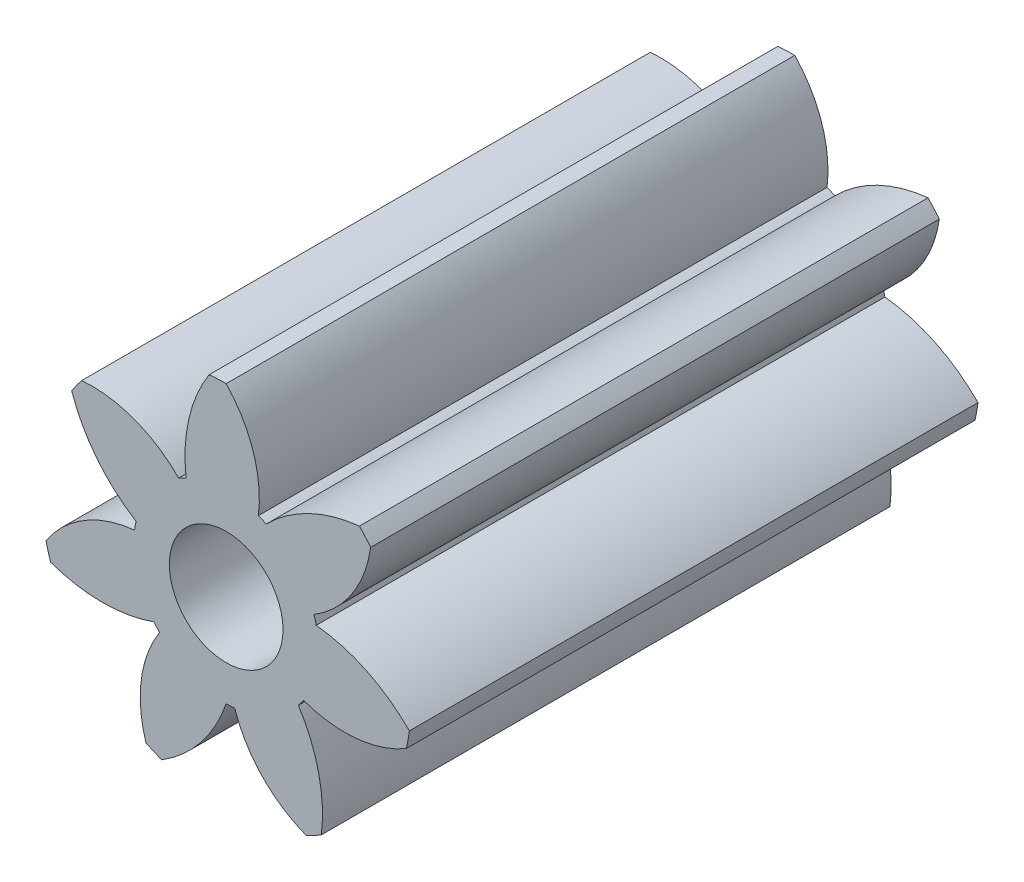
ISO-10303-21;
HEADER;
FILE_DESCRIPTION(('STEP AP214'),'2;1');
FILE_NAME('part.step','',(''),(''),'','','');
FILE_SCHEMA(('AUTOMOTIVE_DESIGN { 1 0 10303 214 1 1 1 1 }'));
ENDSEC;
DATA;
#1=APPLICATION_CONTEXT('core data for automotive mechanical design processes');
#2=APPLICATION_PROTOCOL_DEFINITION('international standard','automotive_design',2000,#1);
#3=PRODUCT_CONTEXT('',#1,'mechanical');
#4=PRODUCT('Part','Part','',(#3));
#5=PRODUCT_RELATED_PRODUCT_CATEGORY('part','',(#4));
#6=PRODUCT_DEFINITION_FORMATION('','',#4);
#7=PRODUCT_DEFINITION_CONTEXT('part definition',#1,'design');
#8=PRODUCT_DEFINITION('design','',#6,#7);
#9=PRODUCT_DEFINITION_SHAPE('','',#8);
#10=(LENGTH_UNIT() NAMED_UNIT(*) SI_UNIT(.MILLI.,.METRE.));
#11=(NAMED_UNIT(*) PLANE_ANGLE_UNIT() SI_UNIT($,.RADIAN.));
#12=(NAMED_UNIT(*) SI_UNIT($,.STERADIAN.) SOLID_ANGLE_UNIT());
#13=UNCERTAINTY_MEASURE_WITH_UNIT(LENGTH_MEASURE(1.E-05),#10,'distance_accuracy_value','');
#14=(GEOMETRIC_REPRESENTATION_CONTEXT(3) GLOBAL_UNCERTAINTY_ASSIGNED_CONTEXT((#13)) GLOBAL_UNIT_ASSIGNED_CONTEXT((#10,
#11,#12)) REPRESENTATION_CONTEXT('',''));
#15=CARTESIAN_POINT('',(0.,0.,0.));
#16=DIRECTION('',(0.,0.,1.));
#17=DIRECTION('',(1.,0.,0.));
#18=AXIS2_PLACEMENT_3D('',#15,#16,#17);
#19=CARTESIAN_POINT('',(0.,0.,4.));
#20=DIRECTION('',(0.,0.,1.));
#21=DIRECTION('',(1.,0.,0.));
#22=AXIS2_PLACEMENT_3D('',#19,#20,#21);
#23=PLANE('',#22);
#24=CARTESIAN_POINT('',(0.,0.,4.));
#25=DIRECTION('',(0.,0.,1.));
#26=DIRECTION('',(1.,0.,0.));
#27=AXIS2_PLACEMENT_3D('',#24,#25,#26);
#28=CIRCLE('',#27,0.4);
#29=CARTESIAN_POINT('',(0.4,0.,4.));
#30=VERTEX_POINT('',#29);
#31=EDGE_CURVE('E251',#30,#30,#28,.T.);
#32=ORIENTED_EDGE('',*,*,#31,.F.);
#33=EDGE_LOOP('',(#32));
#34=FACE_BOUND('',#33,.T.);
#35=CARTESIAN_POINT('',(0.,0.,4.));
#36=DIRECTION('',(0.,0.,1.));
#37=DIRECTION('',(1.,0.,0.));
#38=AXIS2_PLACEMENT_3D('',#35,#36,#37);
#39=CIRCLE('',#38,1.3);
#40=CARTESIAN_POINT('',(-1.01638092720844,0.810536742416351,4.));
#41=VERTEX_POINT('',#40);
#42=CARTESIAN_POINT('',(-1.08684008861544,0.713287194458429,4.));
#43=VERTEX_POINT('',#42);
#44=EDGE_CURVE('E11',#41,#43,#39,.T.);
#45=ORIENTED_EDGE('',*,*,#44,.T.);
#46=CARTESIAN_POINT('',(-0.0663636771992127,1.06160145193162,4.));
#47=DIRECTION('',(0.,0.,1.));
#48=DIRECTION('',(0.623489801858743,0.781831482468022,0.));
#49=AXIS2_PLACEMENT_3D('',#46,#47,#48);
#50=CIRCLE('',#49,1.07828332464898);
#51=CARTESIAN_POINT('',(-0.633703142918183,0.144638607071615,4.));
#52=VERTEX_POINT('',#51);
#53=EDGE_CURVE('E229',#43,#52,#50,.T.);
#54=ORIENTED_EDGE('',*,*,#53,.T.);
#55=CARTESIAN_POINT('',(0.,0.,4.));
#56=DIRECTION('',(0.,0.,1.));
#57=DIRECTION('',(0.623489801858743,0.781831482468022,0.));
#58=AXIS2_PLACEMENT_3D('',#55,#56,#57);
#59=CIRCLE('',#58,0.65);
#60=CARTESIAN_POINT('',(-0.644346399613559,0.0855436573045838,4.));
#61=VERTEX_POINT('',#60);
#62=EDGE_CURVE('E413',#52,#61,#59,.T.);
#63=ORIENTED_EDGE('',*,*,#62,.T.);
#64=CARTESIAN_POINT('',(-0.559357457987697,-0.760994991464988,4.));
#65=DIRECTION('',(0.,0.,1.));
#66=DIRECTION('',(0.623489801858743,0.781831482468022,0.));
#67=AXIS2_PLACEMENT_3D('',#64,#65,#66);
#68=CIRCLE('',#67,0.850794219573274);
#69=CARTESIAN_POINT('',(-1.26740628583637,-0.289277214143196,4.));
#70=VERTEX_POINT('',#69);
#71=EDGE_CURVE('E242',#61,#70,#68,.T.);
#72=ORIENTED_EDGE('',*,*,#71,.T.);
#73=CARTESIAN_POINT('',(-1.23530409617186,-0.404998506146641,4.));
#74=VERTEX_POINT('',#73);
#75=EDGE_CURVE('E44',#70,#74,#39,.T.);
#76=ORIENTED_EDGE('',*,*,#75,.T.);
#77=CARTESIAN_POINT('',(-0.87137051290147,0.6100124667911,4.));
#78=DIRECTION('',(0.,0.,1.));
#79=DIRECTION('',(-0.222520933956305,0.974927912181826,0.));
#80=AXIS2_PLACEMENT_3D('',#77,#78,#79);
#81=CIRCLE('',#80,1.07828332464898);
#82=CARTESIAN_POINT('',(-0.508190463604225,-0.405268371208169,4.));
#83=VERTEX_POINT('',#82);
#84=EDGE_CURVE('E233',#74,#83,#81,.T.);
#85=ORIENTED_EDGE('',*,*,#84,.T.);
#86=CARTESIAN_POINT('',(0.,0.,4.));
#87=DIRECTION('',(0.,0.,1.));
#88=DIRECTION('',(-0.222520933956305,0.974927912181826,0.));
#89=AXIS2_PLACEMENT_3D('',#86,#87,#88);
#90=CIRCLE('',#89,0.65);
#91=CARTESIAN_POINT('',(-0.468624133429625,-0.450434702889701,4.));
#92=VERTEX_POINT('',#91);
#93=EDGE_CURVE('E397',#83,#92,#90,.T.);
#94=ORIENTED_EDGE('',*,*,#93,.T.);
#95=CARTESIAN_POINT('',(0.246216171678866,-0.911795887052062,4.));
#96=DIRECTION('',(0.,0.,1.));
#97=DIRECTION('',(-0.222520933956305,0.974927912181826,0.));
#98=AXIS2_PLACEMENT_3D('',#95,#96,#97);
#99=CIRCLE('',#98,0.850794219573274);
#100=CARTESIAN_POINT('',(-0.564048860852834,-1.17125952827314,4.));
#101=VERTEX_POINT('',#100);
#102=EDGE_CURVE('E393',#92,#101,#99,.T.);
#103=ORIENTED_EDGE('',*,*,#102,.T.);
#104=CARTESIAN_POINT('',(-0.453558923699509,-1.21831207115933,4.));
#105=VERTEX_POINT('',#104);
#106=EDGE_CURVE('E436',#101,#105,#39,.T.);
#107=ORIENTED_EDGE('',*,*,#106,.T.);
#108=CARTESIAN_POINT('',(-1.02021757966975,-0.300928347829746,4.));
#109=DIRECTION('',(0.,0.,1.));
#110=DIRECTION('',(-0.900968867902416,0.433883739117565,0.));
#111=AXIS2_PLACEMENT_3D('',#108,#109,#110);
#112=CIRCLE('',#111,1.07828332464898);
#113=CARTESIAN_POINT('',(0.,-0.65,4.));
#114=VERTEX_POINT('',#113);
#115=EDGE_CURVE('E377',#105,#114,#112,.T.);
#116=ORIENTED_EDGE('',*,*,#115,.T.);
#117=CARTESIAN_POINT('',(0.,0.,4.));
#118=DIRECTION('',(0.,0.,1.));
#119=DIRECTION('',(-0.900968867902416,0.433883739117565,0.));
#120=AXIS2_PLACEMENT_3D('',#117,#118,#119);
#121=CIRCLE('',#120,0.65);
#122=CARTESIAN_POINT('',(0.0599816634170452,-0.647226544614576,4.));
#123=VERTEX_POINT('',#122);
#124=EDGE_CURVE('E374',#114,#123,#121,.T.);
#125=ORIENTED_EDGE('',*,*,#124,.T.);
#126=CARTESIAN_POINT('',(0.866384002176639,-0.375995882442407,4.));
#127=DIRECTION('',(0.,0.,1.));
#128=DIRECTION('',(-0.900968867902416,0.433883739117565,0.));
#129=AXIS2_PLACEMENT_3D('',#126,#127,#128);
#130=CIRCLE('',#129,0.850794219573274);
#131=CARTESIAN_POINT('',(0.564048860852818,-1.17125952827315,4.));
#132=VERTEX_POINT('',#131);
#133=EDGE_CURVE('E370',#123,#132,#130,.T.);
#134=ORIENTED_EDGE('',*,*,#133,.T.);
#135=CARTESIAN_POINT('',(0.66972536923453,-1.11421179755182,4.));
#136=VERTEX_POINT('',#135);
#137=EDGE_CURVE('E437',#132,#136,#39,.T.);
#138=ORIENTED_EDGE('',*,*,#137,.T.);
#139=CARTESIAN_POINT('',(-0.400820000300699,-0.985263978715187,4.));
#140=DIRECTION('',(0.,0.,1.));
#141=DIRECTION('',(-0.900968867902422,-0.433883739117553,0.));
#142=AXIS2_PLACEMENT_3D('',#139,#140,#141);
#143=CIRCLE('',#142,1.07828332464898);
#144=CARTESIAN_POINT('',(0.508190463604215,-0.405268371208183,4.));
#145=VERTEX_POINT('',#144);
#146=EDGE_CURVE('E353',#136,#145,#143,.T.);
#147=ORIENTED_EDGE('',*,*,#146,.T.);
#148=CARTESIAN_POINT('',(0.,0.,4.));
#149=DIRECTION('',(0.,0.,1.));
#150=DIRECTION('',(-0.900968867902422,-0.433883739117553,0.));
#151=AXIS2_PLACEMENT_3D('',#148,#149,#150);
#152=CIRCLE('',#151,0.65);
#153=CARTESIAN_POINT('',(0.543420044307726,-0.356643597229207,4.));
#154=VERTEX_POINT('',#153);
#155=EDGE_CURVE('E350',#145,#154,#152,.T.);
#156=ORIENTED_EDGE('',*,*,#155,.T.);
#157=CARTESIAN_POINT('',(0.83414700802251,0.442936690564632,4.));
#158=DIRECTION('',(0.,0.,1.));
#159=DIRECTION('',(-0.900968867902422,-0.433883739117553,0.));
#160=AXIS2_PLACEMENT_3D('',#157,#158,#159);
#161=CIRCLE('',#160,0.850794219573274);
#162=CARTESIAN_POINT('',(1.26740628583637,-0.289277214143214,4.));
#163=VERTEX_POINT('',#162);
#164=EDGE_CURVE('E346',#154,#163,#161,.T.);
#165=ORIENTED_EDGE('',*,*,#164,.T.);
#166=CARTESIAN_POINT('',(1.28869279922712,-0.171087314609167,4.));
#167=VERTEX_POINT('',#166);
#168=EDGE_CURVE('E440',#163,#167,#39,.T.);
#169=ORIENTED_EDGE('',*,*,#168,.T.);
#170=CARTESIAN_POINT('',(0.520403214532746,-0.927675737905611,4.));
#171=DIRECTION('',(0.,0.,1.));
#172=DIRECTION('',(-0.222520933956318,-0.974927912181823,0.));
#173=AXIS2_PLACEMENT_3D('',#170,#171,#172);
#174=CIRCLE('',#173,1.07828332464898);
#175=CARTESIAN_POINT('',(0.633703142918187,0.144638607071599,4.));
#176=VERTEX_POINT('',#175);
#177=EDGE_CURVE('E329',#167,#176,#174,.T.);
#178=ORIENTED_EDGE('',*,*,#177,.T.);
#179=CARTESIAN_POINT('',(0.,0.,4.));
#180=DIRECTION('',(0.,0.,1.));
#181=DIRECTION('',(-0.222520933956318,-0.974927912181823,0.));
#182=AXIS2_PLACEMENT_3D('',#179,#180,#181);
#183=CIRCLE('',#182,0.65);
#184=CARTESIAN_POINT('',(0.61765204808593,0.202499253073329,4.));
#185=VERTEX_POINT('',#184);
#186=EDGE_CURVE('E326',#176,#185,#183,.T.);
#187=ORIENTED_EDGE('',*,*,#186,.T.);
#188=CARTESIAN_POINT('',(0.173780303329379,0.928328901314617,4.));
#189=DIRECTION('',(0.,0.,1.));
#190=DIRECTION('',(-0.222520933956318,-0.974927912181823,0.));
#191=AXIS2_PLACEMENT_3D('',#188,#189,#190);
#192=CIRCLE('',#191,0.850794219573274);
#193=CARTESIAN_POINT('',(1.01638092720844,0.810536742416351,4.));
#194=VERTEX_POINT('',#193);
#195=EDGE_CURVE('E322',#185,#194,#192,.T.);
#196=ORIENTED_EDGE('',*,*,#195,.T.);
#197=CARTESIAN_POINT('',(0.937248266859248,0.900869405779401,4.));
#198=VERTEX_POINT('',#197);
#199=EDGE_CURVE('E248',#194,#198,#39,.T.);
#200=ORIENTED_EDGE('',*,*,#199,.T.);
#201=CARTESIAN_POINT('',(1.04975219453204,-0.171528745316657,4.));
#202=DIRECTION('',(0.,0.,1.));
#203=DIRECTION('',(0.623489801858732,-0.781831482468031,0.));
#204=AXIS2_PLACEMENT_3D('',#201,#202,#203);
#205=CIRCLE('',#204,1.07828332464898);
#206=CARTESIAN_POINT('',(0.282024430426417,0.585629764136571,4.));
#207=VERTEX_POINT('',#206);
#208=EDGE_CURVE('E305',#198,#207,#205,.T.);
#209=ORIENTED_EDGE('',*,*,#208,.T.);
#210=CARTESIAN_POINT('',(0.,0.,4.));
#211=DIRECTION('',(0.,0.,1.));
#212=DIRECTION('',(0.623489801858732,-0.781831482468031,0.));
#213=AXIS2_PLACEMENT_3D('',#210,#211,#212);
#214=CIRCLE('',#213,0.65);
#215=CARTESIAN_POINT('',(0.226779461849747,0.609156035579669,4.));
#216=VERTEX_POINT('',#215);
#217=EDGE_CURVE('E302',#207,#216,#214,.T.);
#218=ORIENTED_EDGE('',*,*,#217,.T.);
#219=CARTESIAN_POINT('',(-0.61744651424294,0.714670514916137,4.));
#220=DIRECTION('',(0.,0.,1.));
#221=DIRECTION('',(0.623489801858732,-0.781831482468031,0.));
#222=AXIS2_PLACEMENT_3D('',#219,#220,#221);
#223=CIRCLE('',#222,0.850794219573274);
#224=CARTESIAN_POINT('',(0.,1.3,4.));
#225=VERTEX_POINT('',#224);
#226=EDGE_CURVE('E298',#216,#225,#223,.T.);
#227=ORIENTED_EDGE('',*,*,#226,.T.);
#228=CARTESIAN_POINT('',(-0.119963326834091,1.29445308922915,4.));
#229=VERTEX_POINT('',#228);
#230=EDGE_CURVE('E45',#225,#229,#39,.T.);
#231=ORIENTED_EDGE('',*,*,#230,.T.);
#232=CARTESIAN_POINT('',(0.788616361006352,0.713782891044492,4.));
#233=DIRECTION('',(0.,0.,1.));
#234=DIRECTION('',(1.,0.,0.));
#235=AXIS2_PLACEMENT_3D('',#232,#233,#234);
#236=CIRCLE('',#235,1.07828332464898);
#237=CARTESIAN_POINT('',(-0.28202443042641,0.585629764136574,4.));
#238=VERTEX_POINT('',#237);
#239=EDGE_CURVE('E281',#229,#238,#236,.T.);
#240=ORIENTED_EDGE('',*,*,#239,.T.);
#241=CARTESIAN_POINT('',(0.,0.,4.));
#242=DIRECTION('',(0.,0.,1.));
#243=DIRECTION('',(1.,0.,0.));
#244=AXIS2_PLACEMENT_3D('',#241,#242,#243);
#245=CIRCLE('',#244,0.65);
#246=CARTESIAN_POINT('',(-0.334862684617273,0.557105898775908,4.));
#247=VERTEX_POINT('',#246);
#248=EDGE_CURVE('E278',#238,#247,#245,.T.);
#249=ORIENTED_EDGE('',*,*,#248,.T.);
#250=CARTESIAN_POINT('',(-0.94372351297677,-0.0371493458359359,4.));
#251=DIRECTION('',(0.,0.,1.));
#252=DIRECTION('',(1.,0.,0.));
#253=AXIS2_PLACEMENT_3D('',#250,#251,#252);
#254=CIRCLE('',#253,0.850794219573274);
#255=EDGE_CURVE('E274',#247,#41,#254,.T.);
#256=ORIENTED_EDGE('',*,*,#255,.T.);
#257=EDGE_LOOP('',(#45,#54,#63,#72,#76,#85,#94,#103,#107,#116,#125,#134,#138,#147,#156,#165,
#169,#178,#187,#196,#200,#209,#218,#227,#231,#240,#249,#256));
#258=FACE_BOUND('',#257,.T.);
#259=ADVANCED_FACE('F35',(#34,#258),#23,.T.);
#260=CARTESIAN_POINT('',(0.,0.,0.));
#261=DIRECTION('',(0.,0.,1.));
#262=DIRECTION('',(1.,0.,0.));
#263=AXIS2_PLACEMENT_3D('',#260,#261,#262);
#264=PLANE('',#263);
#265=CARTESIAN_POINT('',(0.,0.,0.));
#266=DIRECTION('',(0.,0.,1.));
#267=DIRECTION('',(1.,0.,0.));
#268=AXIS2_PLACEMENT_3D('',#265,#266,#267);
#269=CIRCLE('',#268,0.4);
#270=CARTESIAN_POINT('',(0.4,0.,0.));
#271=VERTEX_POINT('',#270);
#272=EDGE_CURVE('E259',#271,#271,#269,.T.);
#273=ORIENTED_EDGE('',*,*,#272,.T.);
#274=EDGE_LOOP('',(#273));
#275=FACE_BOUND('',#274,.T.);
#276=CARTESIAN_POINT('',(-0.0663636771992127,1.06160145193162,0.));
#277=DIRECTION('',(0.,0.,1.));
#278=DIRECTION('',(0.623489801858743,0.781831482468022,0.));
#279=AXIS2_PLACEMENT_3D('',#276,#277,#278);
#280=CIRCLE('',#279,1.07828332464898);
#281=CARTESIAN_POINT('',(-1.08684008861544,0.713287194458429,0.));
#282=VERTEX_POINT('',#281);
#283=CARTESIAN_POINT('',(-0.633703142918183,0.144638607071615,0.));
#284=VERTEX_POINT('',#283);
#285=EDGE_CURVE('E226',#282,#284,#280,.T.);
#286=ORIENTED_EDGE('',*,*,#285,.F.);
#287=CARTESIAN_POINT('',(0.,0.,0.));
#288=DIRECTION('',(0.,0.,1.));
#289=DIRECTION('',(1.,0.,0.));
#290=AXIS2_PLACEMENT_3D('',#287,#288,#289);
#291=CIRCLE('',#290,1.3);
#292=CARTESIAN_POINT('',(-1.01638092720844,0.810536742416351,0.));
#293=VERTEX_POINT('',#292);
#294=EDGE_CURVE('E39',#293,#282,#291,.T.);
#295=ORIENTED_EDGE('',*,*,#294,.F.);
#296=CARTESIAN_POINT('',(-0.94372351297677,-0.0371493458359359,0.));
#297=DIRECTION('',(0.,0.,1.));
#298=DIRECTION('',(1.,0.,0.));
#299=AXIS2_PLACEMENT_3D('',#296,#297,#298);
#300=CIRCLE('',#299,0.850794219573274);
#301=CARTESIAN_POINT('',(-0.334862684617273,0.557105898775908,0.));
#302=VERTEX_POINT('',#301);
#303=EDGE_CURVE('E273',#302,#293,#300,.T.);
#304=ORIENTED_EDGE('',*,*,#303,.F.);
#305=CARTESIAN_POINT('',(0.,0.,0.));
#306=DIRECTION('',(0.,0.,1.));
#307=DIRECTION('',(1.,0.,0.));
#308=AXIS2_PLACEMENT_3D('',#305,#306,#307);
#309=CIRCLE('',#308,0.65);
#310=CARTESIAN_POINT('',(-0.28202443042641,0.585629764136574,0.));
#311=VERTEX_POINT('',#310);
#312=EDGE_CURVE('E286',#311,#302,#309,.T.);
#313=ORIENTED_EDGE('',*,*,#312,.F.);
#314=CARTESIAN_POINT('',(0.788616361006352,0.713782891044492,0.));
#315=DIRECTION('',(0.,0.,1.));
#316=DIRECTION('',(1.,0.,0.));
#317=AXIS2_PLACEMENT_3D('',#314,#315,#316);
#318=CIRCLE('',#317,1.07828332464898);
#319=CARTESIAN_POINT('',(-0.119963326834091,1.29445308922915,0.));
#320=VERTEX_POINT('',#319);
#321=EDGE_CURVE('E277',#320,#311,#318,.T.);
#322=ORIENTED_EDGE('',*,*,#321,.F.);
#323=CARTESIAN_POINT('',(0.,1.3,0.));
#324=VERTEX_POINT('',#323);
#325=EDGE_CURVE('E247',#324,#320,#291,.T.);
#326=ORIENTED_EDGE('',*,*,#325,.F.);
#327=CARTESIAN_POINT('',(-0.61744651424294,0.714670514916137,0.));
#328=DIRECTION('',(0.,0.,1.));
#329=DIRECTION('',(0.623489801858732,-0.781831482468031,0.));
#330=AXIS2_PLACEMENT_3D('',#327,#328,#329);
#331=CIRCLE('',#330,0.850794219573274);
#332=CARTESIAN_POINT('',(0.226779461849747,0.609156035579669,0.));
#333=VERTEX_POINT('',#332);
#334=EDGE_CURVE('E297',#333,#324,#331,.T.);
#335=ORIENTED_EDGE('',*,*,#334,.F.);
#336=CARTESIAN_POINT('',(0.,0.,0.));
#337=DIRECTION('',(0.,0.,1.));
#338=DIRECTION('',(0.623489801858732,-0.781831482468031,0.));
#339=AXIS2_PLACEMENT_3D('',#336,#337,#338);
#340=CIRCLE('',#339,0.65);
#341=CARTESIAN_POINT('',(0.282024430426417,0.585629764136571,0.));
#342=VERTEX_POINT('',#341);
#343=EDGE_CURVE('E310',#342,#333,#340,.T.);
#344=ORIENTED_EDGE('',*,*,#343,.F.);
#345=CARTESIAN_POINT('',(1.04975219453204,-0.171528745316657,0.));
#346=DIRECTION('',(0.,0.,1.));
#347=DIRECTION('',(0.623489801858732,-0.781831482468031,0.));
#348=AXIS2_PLACEMENT_3D('',#345,#346,#347);
#349=CIRCLE('',#348,1.07828332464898);
#350=CARTESIAN_POINT('',(0.937248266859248,0.900869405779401,0.));
#351=VERTEX_POINT('',#350);
#352=EDGE_CURVE('E301',#351,#342,#349,.T.);
#353=ORIENTED_EDGE('',*,*,#352,.F.);
#354=CARTESIAN_POINT('',(1.01638092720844,0.810536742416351,0.));
#355=VERTEX_POINT('',#354);
#356=EDGE_CURVE('E250',#355,#351,#291,.T.);
#357=ORIENTED_EDGE('',*,*,#356,.F.);
#358=CARTESIAN_POINT('',(0.173780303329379,0.928328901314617,0.));
#359=DIRECTION('',(0.,0.,1.));
#360=DIRECTION('',(-0.222520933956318,-0.974927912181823,0.));
#361=AXIS2_PLACEMENT_3D('',#358,#359,#360);
#362=CIRCLE('',#361,0.850794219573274);
#363=CARTESIAN_POINT('',(0.61765204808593,0.202499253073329,0.));
#364=VERTEX_POINT('',#363);
#365=EDGE_CURVE('E321',#364,#355,#362,.T.);
#366=ORIENTED_EDGE('',*,*,#365,.F.);
#367=CARTESIAN_POINT('',(0.,0.,0.));
#368=DIRECTION('',(0.,0.,1.));
#369=DIRECTION('',(-0.222520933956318,-0.974927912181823,0.));
#370=AXIS2_PLACEMENT_3D('',#367,#368,#369);
#371=CIRCLE('',#370,0.65);
#372=CARTESIAN_POINT('',(0.633703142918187,0.144638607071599,0.));
#373=VERTEX_POINT('',#372);
#374=EDGE_CURVE('E334',#373,#364,#371,.T.);
#375=ORIENTED_EDGE('',*,*,#374,.F.);
#376=CARTESIAN_POINT('',(0.520403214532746,-0.927675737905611,0.));
#377=DIRECTION('',(0.,0.,1.));
#378=DIRECTION('',(-0.222520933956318,-0.974927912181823,0.));
#379=AXIS2_PLACEMENT_3D('',#376,#377,#378);
#380=CIRCLE('',#379,1.07828332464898);
#381=CARTESIAN_POINT('',(1.28869279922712,-0.171087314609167,0.));
#382=VERTEX_POINT('',#381);
#383=EDGE_CURVE('E325',#382,#373,#380,.T.);
#384=ORIENTED_EDGE('',*,*,#383,.F.);
#385=CARTESIAN_POINT('',(1.26740628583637,-0.289277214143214,0.));
#386=VERTEX_POINT('',#385);
#387=EDGE_CURVE('E257',#386,#382,#291,.T.);
#388=ORIENTED_EDGE('',*,*,#387,.F.);
#389=CARTESIAN_POINT('',(0.83414700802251,0.442936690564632,0.));
#390=DIRECTION('',(0.,0.,1.));
#391=DIRECTION('',(-0.900968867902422,-0.433883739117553,0.));
#392=AXIS2_PLACEMENT_3D('',#389,#390,#391);
#393=CIRCLE('',#392,0.850794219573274);
#394=CARTESIAN_POINT('',(0.543420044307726,-0.356643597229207,0.));
#395=VERTEX_POINT('',#394);
#396=EDGE_CURVE('E345',#395,#386,#393,.T.);
#397=ORIENTED_EDGE('',*,*,#396,.F.);
#398=CARTESIAN_POINT('',(0.,0.,0.));
#399=DIRECTION('',(0.,0.,1.));
#400=DIRECTION('',(-0.900968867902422,-0.433883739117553,0.));
#401=AXIS2_PLACEMENT_3D('',#398,#399,#400);
#402=CIRCLE('',#401,0.65);
#403=CARTESIAN_POINT('',(0.508190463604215,-0.405268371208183,0.));
#404=VERTEX_POINT('',#403);
#405=EDGE_CURVE('E358',#404,#395,#402,.T.);
#406=ORIENTED_EDGE('',*,*,#405,.F.);
#407=CARTESIAN_POINT('',(-0.400820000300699,-0.985263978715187,0.));
#408=DIRECTION('',(0.,0.,1.));
#409=DIRECTION('',(-0.900968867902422,-0.433883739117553,0.));
#410=AXIS2_PLACEMENT_3D('',#407,#408,#409);
#411=CIRCLE('',#410,1.07828332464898);
#412=CARTESIAN_POINT('',(0.66972536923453,-1.11421179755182,0.));
#413=VERTEX_POINT('',#412);
#414=EDGE_CURVE('E349',#413,#404,#411,.T.);
#415=ORIENTED_EDGE('',*,*,#414,.F.);
#416=CARTESIAN_POINT('',(0.564048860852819,-1.17125952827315,0.));
#417=VERTEX_POINT('',#416);
#418=EDGE_CURVE('E760',#417,#413,#291,.T.);
#419=ORIENTED_EDGE('',*,*,#418,.F.);
#420=CARTESIAN_POINT('',(0.866384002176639,-0.375995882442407,0.));
#421=DIRECTION('',(0.,0.,1.));
#422=DIRECTION('',(-0.900968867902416,0.433883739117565,0.));
#423=AXIS2_PLACEMENT_3D('',#420,#421,#422);
#424=CIRCLE('',#423,0.850794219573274);
#425=CARTESIAN_POINT('',(0.0599816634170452,-0.647226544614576,0.));
#426=VERTEX_POINT('',#425);
#427=EDGE_CURVE('E369',#426,#417,#424,.T.);
#428=ORIENTED_EDGE('',*,*,#427,.F.);
#429=CARTESIAN_POINT('',(0.,0.,0.));
#430=DIRECTION('',(0.,0.,1.));
#431=DIRECTION('',(-0.900968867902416,0.433883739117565,0.));
#432=AXIS2_PLACEMENT_3D('',#429,#430,#431);
#433=CIRCLE('',#432,0.65);
#434=CARTESIAN_POINT('',(0.,-0.65,0.));
#435=VERTEX_POINT('',#434);
#436=EDGE_CURVE('E382',#435,#426,#433,.T.);
#437=ORIENTED_EDGE('',*,*,#436,.F.);
#438=CARTESIAN_POINT('',(-1.02021757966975,-0.300928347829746,0.));
#439=DIRECTION('',(0.,0.,1.));
#440=DIRECTION('',(-0.900968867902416,0.433883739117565,0.));
#441=AXIS2_PLACEMENT_3D('',#438,#439,#440);
#442=CIRCLE('',#441,1.07828332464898);
#443=CARTESIAN_POINT('',(-0.453558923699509,-1.21831207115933,0.));
#444=VERTEX_POINT('',#443);
#445=EDGE_CURVE('E373',#444,#435,#442,.T.);
#446=ORIENTED_EDGE('',*,*,#445,.F.);
#447=CARTESIAN_POINT('',(-0.564048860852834,-1.17125952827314,0.));
#448=VERTEX_POINT('',#447);
#449=EDGE_CURVE('E249',#448,#444,#291,.T.);
#450=ORIENTED_EDGE('',*,*,#449,.F.);
#451=CARTESIAN_POINT('',(0.246216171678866,-0.911795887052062,0.));
#452=DIRECTION('',(0.,0.,1.));
#453=DIRECTION('',(-0.222520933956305,0.974927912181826,0.));
#454=AXIS2_PLACEMENT_3D('',#451,#452,#453);
#455=CIRCLE('',#454,0.850794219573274);
#456=CARTESIAN_POINT('',(-0.468624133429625,-0.450434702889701,0.));
#457=VERTEX_POINT('',#456);
#458=EDGE_CURVE('E60',#457,#448,#455,.T.);
#459=ORIENTED_EDGE('',*,*,#458,.F.);
#460=CARTESIAN_POINT('',(0.,0.,0.));
#461=DIRECTION('',(0.,0.,1.));
#462=DIRECTION('',(-0.222520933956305,0.974927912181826,0.));
#463=AXIS2_PLACEMENT_3D('',#460,#461,#462);
#464=CIRCLE('',#463,0.65);
#465=CARTESIAN_POINT('',(-0.508190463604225,-0.405268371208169,0.));
#466=VERTEX_POINT('',#465);
#467=EDGE_CURVE('E403',#466,#457,#464,.T.);
#468=ORIENTED_EDGE('',*,*,#467,.F.);
#469=CARTESIAN_POINT('',(-0.87137051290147,0.6100124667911,0.));
#470=DIRECTION('',(0.,0.,1.));
#471=DIRECTION('',(-0.222520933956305,0.974927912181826,0.));
#472=AXIS2_PLACEMENT_3D('',#469,#470,#471);
#473=CIRCLE('',#472,1.07828332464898);
#474=CARTESIAN_POINT('',(-1.23530409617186,-0.404998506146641,0.));
#475=VERTEX_POINT('',#474);
#476=EDGE_CURVE('E396',#475,#466,#473,.T.);
#477=ORIENTED_EDGE('',*,*,#476,.F.);
#478=CARTESIAN_POINT('',(-1.26740628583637,-0.289277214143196,0.));
#479=VERTEX_POINT('',#478);
#480=EDGE_CURVE('E246',#479,#475,#291,.T.);
#481=ORIENTED_EDGE('',*,*,#480,.F.);
#482=CARTESIAN_POINT('',(-0.559357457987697,-0.760994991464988,0.));
#483=DIRECTION('',(0.,0.,1.));
#484=DIRECTION('',(0.623489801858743,0.781831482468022,0.));
#485=AXIS2_PLACEMENT_3D('',#482,#483,#484);
#486=CIRCLE('',#485,0.850794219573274);
#487=CARTESIAN_POINT('',(-0.644346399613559,0.0855436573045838,0.));
#488=VERTEX_POINT('',#487);
#489=EDGE_CURVE('E52',#488,#479,#486,.T.);
#490=ORIENTED_EDGE('',*,*,#489,.F.);
#491=CARTESIAN_POINT('',(0.,0.,0.));
#492=DIRECTION('',(0.,0.,1.));
#493=DIRECTION('',(0.623489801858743,0.781831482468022,0.));
#494=AXIS2_PLACEMENT_3D('',#491,#492,#493);
#495=CIRCLE('',#494,0.65);
#496=EDGE_CURVE('E241',#284,#488,#495,.T.);
#497=ORIENTED_EDGE('',*,*,#496,.F.);
#498=EDGE_LOOP('',(#286,#295,#304,#313,#322,#326,#335,#344,#353,#357,#366,#375,#384,#388,#397,
#406,#415,#419,#428,#437,#446,#450,#459,#468,#477,#481,#490,#497));
#499=FACE_BOUND('',#498,.T.);
#500=ADVANCED_FACE('F239',(#275,#499),#264,.F.);
#501=CARTESIAN_POINT('',(0.,0.,4.));
#502=DIRECTION('',(0.,0.,-1.));
#503=DIRECTION('',(-1.,0.,0.));
#504=AXIS2_PLACEMENT_3D('',#501,#502,#503);
#505=CYLINDRICAL_SURFACE('',#504,1.3);
#506=DIRECTION('',(0.,0.,1.));
#507=VECTOR('',#506,1.);
#508=CARTESIAN_POINT('',(-1.08684008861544,0.713287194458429,0.));
#509=LINE('',#508,#507);
#510=EDGE_CURVE('E223',#282,#43,#509,.T.);
#511=ORIENTED_EDGE('',*,*,#510,.T.);
#512=ORIENTED_EDGE('',*,*,#44,.F.);
#513=DIRECTION('',(0.,0.,1.));
#514=VECTOR('',#513,1.);
#515=CARTESIAN_POINT('',(-1.01638092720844,0.810536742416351,0.));
#516=LINE('',#515,#514);
#517=EDGE_CURVE('E245',#293,#41,#516,.T.);
#518=ORIENTED_EDGE('',*,*,#517,.F.);
#519=ORIENTED_EDGE('',*,*,#294,.T.);
#520=EDGE_LOOP('',(#511,#512,#518,#519));
#521=FACE_BOUND('',#520,.T.);
#522=ADVANCED_FACE('F37',(#521),#505,.T.);
#523=DIRECTION('',(0.,0.,1.));
#524=VECTOR('',#523,1.);
#525=CARTESIAN_POINT('',(-1.26740628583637,-0.289277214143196,0.));
#526=LINE('',#525,#524);
#527=EDGE_CURVE('E409',#479,#70,#526,.T.);
#528=ORIENTED_EDGE('',*,*,#527,.F.);
#529=ORIENTED_EDGE('',*,*,#480,.T.);
#530=DIRECTION('',(0.,0.,1.));
#531=VECTOR('',#530,1.);
#532=CARTESIAN_POINT('',(-1.23530409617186,-0.404998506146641,0.));
#533=LINE('',#532,#531);
#534=EDGE_CURVE('E380',#475,#74,#533,.T.);
#535=ORIENTED_EDGE('',*,*,#534,.T.);
#536=ORIENTED_EDGE('',*,*,#75,.F.);
#537=EDGE_LOOP('',(#528,#529,#535,#536));
#538=FACE_BOUND('',#537,.T.);
#539=ADVANCED_FACE('F428',(#538),#505,.T.);
#540=DIRECTION('',(0.,0.,1.));
#541=VECTOR('',#540,1.);
#542=CARTESIAN_POINT('',(-0.564048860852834,-1.17125952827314,0.));
#543=LINE('',#542,#541);
#544=EDGE_CURVE('E391',#448,#101,#543,.T.);
#545=ORIENTED_EDGE('',*,*,#544,.F.);
#546=ORIENTED_EDGE('',*,*,#449,.T.);
#547=DIRECTION('',(0.,0.,1.));
#548=VECTOR('',#547,1.);
#549=CARTESIAN_POINT('',(-0.453558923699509,-1.21831207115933,0.));
#550=LINE('',#549,#548);
#551=EDGE_CURVE('E356',#444,#105,#550,.T.);
#552=ORIENTED_EDGE('',*,*,#551,.T.);
#553=ORIENTED_EDGE('',*,*,#106,.F.);
#554=EDGE_LOOP('',(#545,#546,#552,#553));
#555=FACE_BOUND('',#554,.T.);
#556=ADVANCED_FACE('F543',(#555),#505,.T.);
#557=DIRECTION('',(0.,0.,1.));
#558=VECTOR('',#557,1.);
#559=CARTESIAN_POINT('',(0.564048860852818,-1.17125952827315,0.));
#560=LINE('',#559,#558);
#561=EDGE_CURVE('E367',#417,#132,#560,.T.);
#562=ORIENTED_EDGE('',*,*,#561,.F.);
#563=ORIENTED_EDGE('',*,*,#418,.T.);
#564=DIRECTION('',(0.,0.,1.));
#565=VECTOR('',#564,1.);
#566=CARTESIAN_POINT('',(0.66972536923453,-1.11421179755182,0.));
#567=LINE('',#566,#565);
#568=EDGE_CURVE('E332',#413,#136,#567,.T.);
#569=ORIENTED_EDGE('',*,*,#568,.T.);
#570=ORIENTED_EDGE('',*,*,#137,.F.);
#571=EDGE_LOOP('',(#562,#563,#569,#570));
#572=FACE_BOUND('',#571,.T.);
#573=ADVANCED_FACE('F551',(#572),#505,.T.);
#574=DIRECTION('',(0.,0.,1.));
#575=VECTOR('',#574,1.);
#576=CARTESIAN_POINT('',(1.26740628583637,-0.289277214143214,0.));
#577=LINE('',#576,#575);
#578=EDGE_CURVE('E343',#386,#163,#577,.T.);
#579=ORIENTED_EDGE('',*,*,#578,.F.);
#580=ORIENTED_EDGE('',*,*,#387,.T.);
#581=DIRECTION('',(0.,0.,1.));
#582=VECTOR('',#581,1.);
#583=CARTESIAN_POINT('',(1.28869279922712,-0.171087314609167,0.));
#584=LINE('',#583,#582);
#585=EDGE_CURVE('E308',#382,#167,#584,.T.);
#586=ORIENTED_EDGE('',*,*,#585,.T.);
#587=ORIENTED_EDGE('',*,*,#168,.F.);
#588=EDGE_LOOP('',(#579,#580,#586,#587));
#589=FACE_BOUND('',#588,.T.);
#590=ADVANCED_FACE('F560',(#589),#505,.T.);
#591=DIRECTION('',(0.,0.,1.));
#592=VECTOR('',#591,1.);
#593=CARTESIAN_POINT('',(1.01638092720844,0.810536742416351,0.));
#594=LINE('',#593,#592);
#595=EDGE_CURVE('E319',#355,#194,#594,.T.);
#596=ORIENTED_EDGE('',*,*,#595,.F.);
#597=ORIENTED_EDGE('',*,*,#356,.T.);
#598=DIRECTION('',(0.,0.,1.));
#599=VECTOR('',#598,1.);
#600=CARTESIAN_POINT('',(0.937248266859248,0.900869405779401,0.));
#601=LINE('',#600,#599);
#602=EDGE_CURVE('E284',#351,#198,#601,.T.);
#603=ORIENTED_EDGE('',*,*,#602,.T.);
#604=ORIENTED_EDGE('',*,*,#199,.F.);
#605=EDGE_LOOP('',(#596,#597,#603,#604));
#606=FACE_BOUND('',#605,.T.);
#607=ADVANCED_FACE('F456',(#606),#505,.T.);
#608=DIRECTION('',(0.,0.,1.));
#609=VECTOR('',#608,1.);
#610=CARTESIAN_POINT('',(0.,1.3,0.));
#611=LINE('',#610,#609);
#612=EDGE_CURVE('E295',#324,#225,#611,.T.);
#613=ORIENTED_EDGE('',*,*,#612,.F.);
#614=ORIENTED_EDGE('',*,*,#325,.T.);
#615=DIRECTION('',(0.,0.,1.));
#616=VECTOR('',#615,1.);
#617=CARTESIAN_POINT('',(-0.119963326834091,1.29445308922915,0.));
#618=LINE('',#617,#616);
#619=EDGE_CURVE('E264',#320,#229,#618,.T.);
#620=ORIENTED_EDGE('',*,*,#619,.T.);
#621=ORIENTED_EDGE('',*,*,#230,.F.);
#622=EDGE_LOOP('',(#613,#614,#620,#621));
#623=FACE_BOUND('',#622,.T.);
#624=ADVANCED_FACE('F469',(#623),#505,.T.);
#625=CARTESIAN_POINT('',(0.,0.,4.));
#626=DIRECTION('',(0.,0.,-1.));
#627=DIRECTION('',(-1.,0.,0.));
#628=AXIS2_PLACEMENT_3D('',#625,#626,#627);
#629=CYLINDRICAL_SURFACE('',#628,0.4);
#630=ORIENTED_EDGE('',*,*,#31,.T.);
#631=EDGE_LOOP('',(#630));
#632=FACE_BOUND('',#631,.T.);
#633=ORIENTED_EDGE('',*,*,#272,.F.);
#634=EDGE_LOOP('',(#633));
#635=FACE_BOUND('',#634,.T.);
#636=ADVANCED_FACE('F498',(#632,#635),#629,.F.);
#637=CARTESIAN_POINT('',(0.788616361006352,0.713782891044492,0.));
#638=DIRECTION('',(0.,0.,1.));
#639=DIRECTION('',(1.,0.,0.));
#640=AXIS2_PLACEMENT_3D('',#637,#638,#639);
#641=CYLINDRICAL_SURFACE('',#640,1.07828332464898);
#642=ORIENTED_EDGE('',*,*,#239,.F.);
#643=ORIENTED_EDGE('',*,*,#619,.F.);
#644=ORIENTED_EDGE('',*,*,#321,.T.);
#645=DIRECTION('',(0.,0.,1.));
#646=VECTOR('',#645,1.);
#647=CARTESIAN_POINT('',(-0.28202443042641,0.585629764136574,0.));
#648=LINE('',#647,#646);
#649=EDGE_CURVE('E268',#311,#238,#648,.T.);
#650=ORIENTED_EDGE('',*,*,#649,.T.);
#651=EDGE_LOOP('',(#642,#643,#644,#650));
#652=FACE_BOUND('',#651,.T.);
#653=ADVANCED_FACE('F472',(#652),#641,.T.);
#654=CARTESIAN_POINT('',(0.,0.,0.));
#655=DIRECTION('',(0.,0.,1.));
#656=DIRECTION('',(1.,0.,0.));
#657=AXIS2_PLACEMENT_3D('',#654,#655,#656);
#658=CYLINDRICAL_SURFACE('',#657,0.65);
#659=ORIENTED_EDGE('',*,*,#248,.F.);
#660=ORIENTED_EDGE('',*,*,#649,.F.);
#661=ORIENTED_EDGE('',*,*,#312,.T.);
#662=DIRECTION('',(0.,0.,1.));
#663=VECTOR('',#662,1.);
#664=CARTESIAN_POINT('',(-0.334862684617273,0.557105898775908,0.));
#665=LINE('',#664,#663);
#666=EDGE_CURVE('E270',#302,#247,#665,.T.);
#667=ORIENTED_EDGE('',*,*,#666,.T.);
#668=EDGE_LOOP('',(#659,#660,#661,#667));
#669=FACE_BOUND('',#668,.T.);
#670=ADVANCED_FACE('F478',(#669),#658,.T.);
#671=CARTESIAN_POINT('',(-0.94372351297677,-0.0371493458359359,0.));
#672=DIRECTION('',(0.,0.,1.));
#673=DIRECTION('',(1.,0.,0.));
#674=AXIS2_PLACEMENT_3D('',#671,#672,#673);
#675=CYLINDRICAL_SURFACE('',#674,0.850794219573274);
#676=ORIENTED_EDGE('',*,*,#255,.F.);
#677=ORIENTED_EDGE('',*,*,#666,.F.);
#678=ORIENTED_EDGE('',*,*,#303,.T.);
#679=ORIENTED_EDGE('',*,*,#517,.T.);
#680=EDGE_LOOP('',(#676,#677,#678,#679));
#681=FACE_BOUND('',#680,.T.);
#682=ADVANCED_FACE('F481',(#681),#675,.T.);
#683=CARTESIAN_POINT('',(1.04975219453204,-0.171528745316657,0.));
#684=DIRECTION('',(0.,0.,1.));
#685=DIRECTION('',(1.,0.,0.));
#686=AXIS2_PLACEMENT_3D('',#683,#684,#685);
#687=CYLINDRICAL_SURFACE('',#686,1.07828332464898);
#688=ORIENTED_EDGE('',*,*,#208,.F.);
#689=ORIENTED_EDGE('',*,*,#602,.F.);
#690=ORIENTED_EDGE('',*,*,#352,.T.);
#691=DIRECTION('',(0.,0.,1.));
#692=VECTOR('',#691,1.);
#693=CARTESIAN_POINT('',(0.282024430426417,0.585629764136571,0.));
#694=LINE('',#693,#692);
#695=EDGE_CURVE('E291',#342,#207,#694,.T.);
#696=ORIENTED_EDGE('',*,*,#695,.T.);
#697=EDGE_LOOP('',(#688,#689,#690,#696));
#698=FACE_BOUND('',#697,.T.);
#699=ADVANCED_FACE('F452',(#698),#687,.T.);
#700=CARTESIAN_POINT('',(0.,0.,0.));
#701=DIRECTION('',(0.,0.,1.));
#702=DIRECTION('',(1.,0.,0.));
#703=AXIS2_PLACEMENT_3D('',#700,#701,#702);
#704=CYLINDRICAL_SURFACE('',#703,0.65);
#705=ORIENTED_EDGE('',*,*,#217,.F.);
#706=ORIENTED_EDGE('',*,*,#695,.F.);
#707=ORIENTED_EDGE('',*,*,#343,.T.);
#708=DIRECTION('',(0.,0.,1.));
#709=VECTOR('',#708,1.);
#710=CARTESIAN_POINT('',(0.226779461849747,0.609156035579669,0.));
#711=LINE('',#710,#709);
#712=EDGE_CURVE('E293',#333,#216,#711,.T.);
#713=ORIENTED_EDGE('',*,*,#712,.T.);
#714=EDGE_LOOP('',(#705,#706,#707,#713));
#715=FACE_BOUND('',#714,.T.);
#716=ADVANCED_FACE('F463',(#715),#704,.T.);
#717=CARTESIAN_POINT('',(-0.61744651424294,0.714670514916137,0.));
#718=DIRECTION('',(0.,0.,1.));
#719=DIRECTION('',(1.,0.,0.));
#720=AXIS2_PLACEMENT_3D('',#717,#718,#719);
#721=CYLINDRICAL_SURFACE('',#720,0.850794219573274);
#722=ORIENTED_EDGE('',*,*,#226,.F.);
#723=ORIENTED_EDGE('',*,*,#712,.F.);
#724=ORIENTED_EDGE('',*,*,#334,.T.);
#725=ORIENTED_EDGE('',*,*,#612,.T.);
#726=EDGE_LOOP('',(#722,#723,#724,#725));
#727=FACE_BOUND('',#726,.T.);
#728=ADVANCED_FACE('F594',(#727),#721,.T.);
#729=CARTESIAN_POINT('',(0.520403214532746,-0.927675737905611,0.));
#730=DIRECTION('',(0.,0.,1.));
#731=DIRECTION('',(1.,0.,0.));
#732=AXIS2_PLACEMENT_3D('',#729,#730,#731);
#733=CYLINDRICAL_SURFACE('',#732,1.07828332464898);
#734=ORIENTED_EDGE('',*,*,#177,.F.);
#735=ORIENTED_EDGE('',*,*,#585,.F.);
#736=ORIENTED_EDGE('',*,*,#383,.T.);
#737=DIRECTION('',(0.,0.,1.));
#738=VECTOR('',#737,1.);
#739=CARTESIAN_POINT('',(0.633703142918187,0.144638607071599,0.));
#740=LINE('',#739,#738);
#741=EDGE_CURVE('E315',#373,#176,#740,.T.);
#742=ORIENTED_EDGE('',*,*,#741,.T.);
#743=EDGE_LOOP('',(#734,#735,#736,#742));
#744=FACE_BOUND('',#743,.T.);
#745=ADVANCED_FACE('F603',(#744),#733,.T.);
#746=CARTESIAN_POINT('',(0.,0.,0.));
#747=DIRECTION('',(0.,0.,1.));
#748=DIRECTION('',(1.,0.,0.));
#749=AXIS2_PLACEMENT_3D('',#746,#747,#748);
#750=CYLINDRICAL_SURFACE('',#749,0.65);
#751=ORIENTED_EDGE('',*,*,#186,.F.);
#752=ORIENTED_EDGE('',*,*,#741,.F.);
#753=ORIENTED_EDGE('',*,*,#374,.T.);
#754=DIRECTION('',(0.,0.,1.));
#755=VECTOR('',#754,1.);
#756=CARTESIAN_POINT('',(0.61765204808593,0.202499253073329,0.));
#757=LINE('',#756,#755);
#758=EDGE_CURVE('E317',#364,#185,#757,.T.);
#759=ORIENTED_EDGE('',*,*,#758,.T.);
#760=EDGE_LOOP('',(#751,#752,#753,#759));
#761=FACE_BOUND('',#760,.T.);
#762=ADVANCED_FACE('F612',(#761),#750,.T.);
#763=CARTESIAN_POINT('',(0.173780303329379,0.928328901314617,0.));
#764=DIRECTION('',(0.,0.,1.));
#765=DIRECTION('',(1.,0.,0.));
#766=AXIS2_PLACEMENT_3D('',#763,#764,#765);
#767=CYLINDRICAL_SURFACE('',#766,0.850794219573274);
#768=ORIENTED_EDGE('',*,*,#195,.F.);
#769=ORIENTED_EDGE('',*,*,#758,.F.);
#770=ORIENTED_EDGE('',*,*,#365,.T.);
#771=ORIENTED_EDGE('',*,*,#595,.T.);
#772=EDGE_LOOP('',(#768,#769,#770,#771));
#773=FACE_BOUND('',#772,.T.);
#774=ADVANCED_FACE('F622',(#773),#767,.T.);
#775=CARTESIAN_POINT('',(-0.400820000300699,-0.985263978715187,0.));
#776=DIRECTION('',(0.,0.,1.));
#777=DIRECTION('',(1.,0.,0.));
#778=AXIS2_PLACEMENT_3D('',#775,#776,#777);
#779=CYLINDRICAL_SURFACE('',#778,1.07828332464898);
#780=ORIENTED_EDGE('',*,*,#146,.F.);
#781=ORIENTED_EDGE('',*,*,#568,.F.);
#782=ORIENTED_EDGE('',*,*,#414,.T.);
#783=DIRECTION('',(0.,0.,1.));
#784=VECTOR('',#783,1.);
#785=CARTESIAN_POINT('',(0.508190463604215,-0.405268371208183,0.));
#786=LINE('',#785,#784);
#787=EDGE_CURVE('E339',#404,#145,#786,.T.);
#788=ORIENTED_EDGE('',*,*,#787,.T.);
#789=EDGE_LOOP('',(#780,#781,#782,#788));
#790=FACE_BOUND('',#789,.T.);
#791=ADVANCED_FACE('F632',(#790),#779,.T.);
#792=CARTESIAN_POINT('',(0.,0.,0.));
#793=DIRECTION('',(0.,0.,1.));
#794=DIRECTION('',(1.,0.,0.));
#795=AXIS2_PLACEMENT_3D('',#792,#793,#794);
#796=CYLINDRICAL_SURFACE('',#795,0.65);
#797=ORIENTED_EDGE('',*,*,#155,.F.);
#798=ORIENTED_EDGE('',*,*,#787,.F.);
#799=ORIENTED_EDGE('',*,*,#405,.T.);
#800=DIRECTION('',(0.,0.,1.));
#801=VECTOR('',#800,1.);
#802=CARTESIAN_POINT('',(0.543420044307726,-0.356643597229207,0.));
#803=LINE('',#802,#801);
#804=EDGE_CURVE('E341',#395,#154,#803,.T.);
#805=ORIENTED_EDGE('',*,*,#804,.T.);
#806=EDGE_LOOP('',(#797,#798,#799,#805));
#807=FACE_BOUND('',#806,.T.);
#808=ADVANCED_FACE('F642',(#807),#796,.T.);
#809=CARTESIAN_POINT('',(0.83414700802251,0.442936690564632,0.));
#810=DIRECTION('',(0.,0.,1.));
#811=DIRECTION('',(1.,0.,0.));
#812=AXIS2_PLACEMENT_3D('',#809,#810,#811);
#813=CYLINDRICAL_SURFACE('',#812,0.850794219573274);
#814=ORIENTED_EDGE('',*,*,#164,.F.);
#815=ORIENTED_EDGE('',*,*,#804,.F.);
#816=ORIENTED_EDGE('',*,*,#396,.T.);
#817=ORIENTED_EDGE('',*,*,#578,.T.);
#818=EDGE_LOOP('',(#814,#815,#816,#817));
#819=FACE_BOUND('',#818,.T.);
#820=ADVANCED_FACE('F652',(#819),#813,.T.);
#821=CARTESIAN_POINT('',(-1.02021757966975,-0.300928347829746,0.));
#822=DIRECTION('',(0.,0.,1.));
#823=DIRECTION('',(1.,0.,0.));
#824=AXIS2_PLACEMENT_3D('',#821,#822,#823);
#825=CYLINDRICAL_SURFACE('',#824,1.07828332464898);
#826=ORIENTED_EDGE('',*,*,#115,.F.);
#827=ORIENTED_EDGE('',*,*,#551,.F.);
#828=ORIENTED_EDGE('',*,*,#445,.T.);
#829=DIRECTION('',(0.,0.,1.));
#830=VECTOR('',#829,1.);
#831=CARTESIAN_POINT('',(0.,-0.65,0.));
#832=LINE('',#831,#830);
#833=EDGE_CURVE('E363',#435,#114,#832,.T.);
#834=ORIENTED_EDGE('',*,*,#833,.T.);
#835=EDGE_LOOP('',(#826,#827,#828,#834));
#836=FACE_BOUND('',#835,.T.);
#837=ADVANCED_FACE('F662',(#836),#825,.T.);
#838=CARTESIAN_POINT('',(0.,0.,0.));
#839=DIRECTION('',(0.,0.,1.));
#840=DIRECTION('',(1.,0.,0.));
#841=AXIS2_PLACEMENT_3D('',#838,#839,#840);
#842=CYLINDRICAL_SURFACE('',#841,0.65);
#843=ORIENTED_EDGE('',*,*,#124,.F.);
#844=ORIENTED_EDGE('',*,*,#833,.F.);
#845=ORIENTED_EDGE('',*,*,#436,.T.);
#846=DIRECTION('',(0.,0.,1.));
#847=VECTOR('',#846,1.);
#848=CARTESIAN_POINT('',(0.0599816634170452,-0.647226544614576,0.));
#849=LINE('',#848,#847);
#850=EDGE_CURVE('E365',#426,#123,#849,.T.);
#851=ORIENTED_EDGE('',*,*,#850,.T.);
#852=EDGE_LOOP('',(#843,#844,#845,#851));
#853=FACE_BOUND('',#852,.T.);
#854=ADVANCED_FACE('F672',(#853),#842,.T.);
#855=CARTESIAN_POINT('',(0.866384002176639,-0.375995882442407,0.));
#856=DIRECTION('',(0.,0.,1.));
#857=DIRECTION('',(1.,0.,0.));
#858=AXIS2_PLACEMENT_3D('',#855,#856,#857);
#859=CYLINDRICAL_SURFACE('',#858,0.850794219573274);
#860=ORIENTED_EDGE('',*,*,#133,.F.);
#861=ORIENTED_EDGE('',*,*,#850,.F.);
#862=ORIENTED_EDGE('',*,*,#427,.T.);
#863=ORIENTED_EDGE('',*,*,#561,.T.);
#864=EDGE_LOOP('',(#860,#861,#862,#863));
#865=FACE_BOUND('',#864,.T.);
#866=ADVANCED_FACE('F682',(#865),#859,.T.);
#867=CARTESIAN_POINT('',(-0.87137051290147,0.6100124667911,0.));
#868=DIRECTION('',(0.,0.,1.));
#869=DIRECTION('',(1.,0.,0.));
#870=AXIS2_PLACEMENT_3D('',#867,#868,#869);
#871=CYLINDRICAL_SURFACE('',#870,1.07828332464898);
#872=ORIENTED_EDGE('',*,*,#84,.F.);
#873=ORIENTED_EDGE('',*,*,#534,.F.);
#874=ORIENTED_EDGE('',*,*,#476,.T.);
#875=DIRECTION('',(0.,0.,1.));
#876=VECTOR('',#875,1.);
#877=CARTESIAN_POINT('',(-0.508190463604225,-0.405268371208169,0.));
#878=LINE('',#877,#876);
#879=EDGE_CURVE('E387',#466,#83,#878,.T.);
#880=ORIENTED_EDGE('',*,*,#879,.T.);
#881=EDGE_LOOP('',(#872,#873,#874,#880));
#882=FACE_BOUND('',#881,.T.);
#883=ADVANCED_FACE('F432',(#882),#871,.T.);
#884=CARTESIAN_POINT('',(0.,0.,0.));
#885=DIRECTION('',(0.,0.,1.));
#886=DIRECTION('',(1.,0.,0.));
#887=AXIS2_PLACEMENT_3D('',#884,#885,#886);
#888=CYLINDRICAL_SURFACE('',#887,0.65);
#889=ORIENTED_EDGE('',*,*,#93,.F.);
#890=ORIENTED_EDGE('',*,*,#879,.F.);
#891=ORIENTED_EDGE('',*,*,#467,.T.);
#892=DIRECTION('',(0.,0.,1.));
#893=VECTOR('',#892,1.);
#894=CARTESIAN_POINT('',(-0.468624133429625,-0.450434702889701,0.));
#895=LINE('',#894,#893);
#896=EDGE_CURVE('E389',#457,#92,#895,.T.);
#897=ORIENTED_EDGE('',*,*,#896,.T.);
#898=EDGE_LOOP('',(#889,#890,#891,#897));
#899=FACE_BOUND('',#898,.T.);
#900=ADVANCED_FACE('F701',(#899),#888,.T.);
#901=CARTESIAN_POINT('',(0.246216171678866,-0.911795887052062,0.));
#902=DIRECTION('',(0.,0.,1.));
#903=DIRECTION('',(1.,0.,0.));
#904=AXIS2_PLACEMENT_3D('',#901,#902,#903);
#905=CYLINDRICAL_SURFACE('',#904,0.850794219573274);
#906=ORIENTED_EDGE('',*,*,#102,.F.);
#907=ORIENTED_EDGE('',*,*,#896,.F.);
#908=ORIENTED_EDGE('',*,*,#458,.T.);
#909=ORIENTED_EDGE('',*,*,#544,.T.);
#910=EDGE_LOOP('',(#906,#907,#908,#909));
#911=FACE_BOUND('',#910,.T.);
#912=ADVANCED_FACE('F710',(#911),#905,.T.);
#913=CARTESIAN_POINT('',(-0.0663636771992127,1.06160145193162,0.));
#914=DIRECTION('',(0.,0.,1.));
#915=DIRECTION('',(1.,0.,0.));
#916=AXIS2_PLACEMENT_3D('',#913,#914,#915);
#917=CYLINDRICAL_SURFACE('',#916,1.07828332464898);
#918=ORIENTED_EDGE('',*,*,#53,.F.);
#919=ORIENTED_EDGE('',*,*,#510,.F.);
#920=ORIENTED_EDGE('',*,*,#285,.T.);
#921=DIRECTION('',(0.,0.,1.));
#922=VECTOR('',#921,1.);
#923=CARTESIAN_POINT('',(-0.633703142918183,0.144638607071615,0.));
#924=LINE('',#923,#922);
#925=EDGE_CURVE('E234',#284,#52,#924,.T.);
#926=ORIENTED_EDGE('',*,*,#925,.T.);
#927=EDGE_LOOP('',(#918,#919,#920,#926));
#928=FACE_BOUND('',#927,.T.);
#929=ADVANCED_FACE('F225',(#928),#917,.T.);
#930=CARTESIAN_POINT('',(0.,0.,0.));
#931=DIRECTION('',(0.,0.,1.));
#932=DIRECTION('',(1.,0.,0.));
#933=AXIS2_PLACEMENT_3D('',#930,#931,#932);
#934=CYLINDRICAL_SURFACE('',#933,0.65);
#935=ORIENTED_EDGE('',*,*,#62,.F.);
#936=ORIENTED_EDGE('',*,*,#925,.F.);
#937=ORIENTED_EDGE('',*,*,#496,.T.);
#938=DIRECTION('',(0.,0.,1.));
#939=VECTOR('',#938,1.);
#940=CARTESIAN_POINT('',(-0.644346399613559,0.0855436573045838,0.));
#941=LINE('',#940,#939);
#942=EDGE_CURVE('E407',#488,#61,#941,.T.);
#943=ORIENTED_EDGE('',*,*,#942,.T.);
#944=EDGE_LOOP('',(#935,#936,#937,#943));
#945=FACE_BOUND('',#944,.T.);
#946=ADVANCED_FACE('F420',(#945),#934,.T.);
#947=CARTESIAN_POINT('',(-0.559357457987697,-0.760994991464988,0.));
#948=DIRECTION('',(0.,0.,1.));
#949=DIRECTION('',(1.,0.,0.));
#950=AXIS2_PLACEMENT_3D('',#947,#948,#949);
#951=CYLINDRICAL_SURFACE('',#950,0.850794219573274);
#952=ORIENTED_EDGE('',*,*,#71,.F.);
#953=ORIENTED_EDGE('',*,*,#942,.F.);
#954=ORIENTED_EDGE('',*,*,#489,.T.);
#955=ORIENTED_EDGE('',*,*,#527,.T.);
#956=EDGE_LOOP('',(#952,#953,#954,#955));
#957=FACE_BOUND('',#956,.T.);
#958=ADVANCED_FACE('F422',(#957),#951,.T.);
#959=CLOSED_SHELL('',(#259,#500,#522,#539,#556,#573,#590,#607,#624,#636,#653,#670,#682,#699,
#716,#728,#745,#762,#774,#791,#808,#820,#837,#854,#866,#883,#900,#912,#929,#946,#958));
#960=MANIFOLD_SOLID_BREP('B2',#959);
#961=ADVANCED_BREP_SHAPE_REPRESENTATION('',(#18,#960),#14);
#962=SHAPE_DEFINITION_REPRESENTATION(#9,#961);
ENDSEC;
END-ISO-10303-21;
